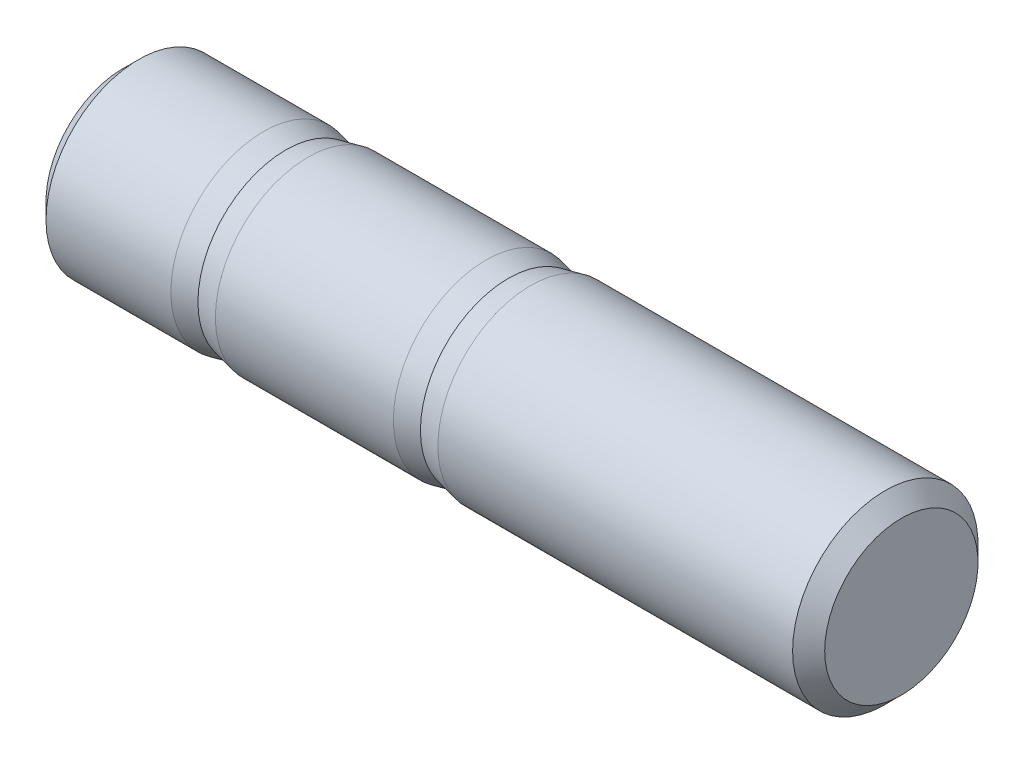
from build123d import *

# Parameters (mm, degrees)
HEADCHAMFER_SIZE = 0.433


with BuildPart() as part:
    # Sketch1 → BaseHead (revolve)
    with BuildSketch(Plane.XY, mode=Mode.PRIVATE) as basehead_sk:
        Polygon((0, 0), (0, 2.5), (3.8, 2.5), (5, 2.24), (9.8, 2.24), (11, 2.5), (21, 2.5), (21, 0), align=None)
    revolve(basehead_sk.sketch.rotate(Axis((-1.310841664, 0, 0), (1, 0, 0)), 90), axis=Axis((-1.310841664, 0, 0), (1, 0, 0)))

    # HeadChamfer
    headchamfer_edges = [part.edges().sort_by_distance(p)[0] for p in [
        (21, 0, -2.5),
        (0, 0, -2.5),
    ]]
    chamfer(headchamfer_edges, length=HEADCHAMFER_SIZE)

    # Sketch2 → BaseBody (revolve)
    with BuildSketch(Plane.XY, mode=Mode.PRIVATE) as basebody_sk:
        Polygon((3.8, 2.24), (5, 2.5), (9.8, 2.5), (11, 2.24), align=None)
    revolve(basebody_sk.sketch.rotate(Axis((4.977430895, 0, 0), (1, 0, 0)), 90), axis=Axis((4.977430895, 0, 0), (1, 0, 0)))


solid = part.part
